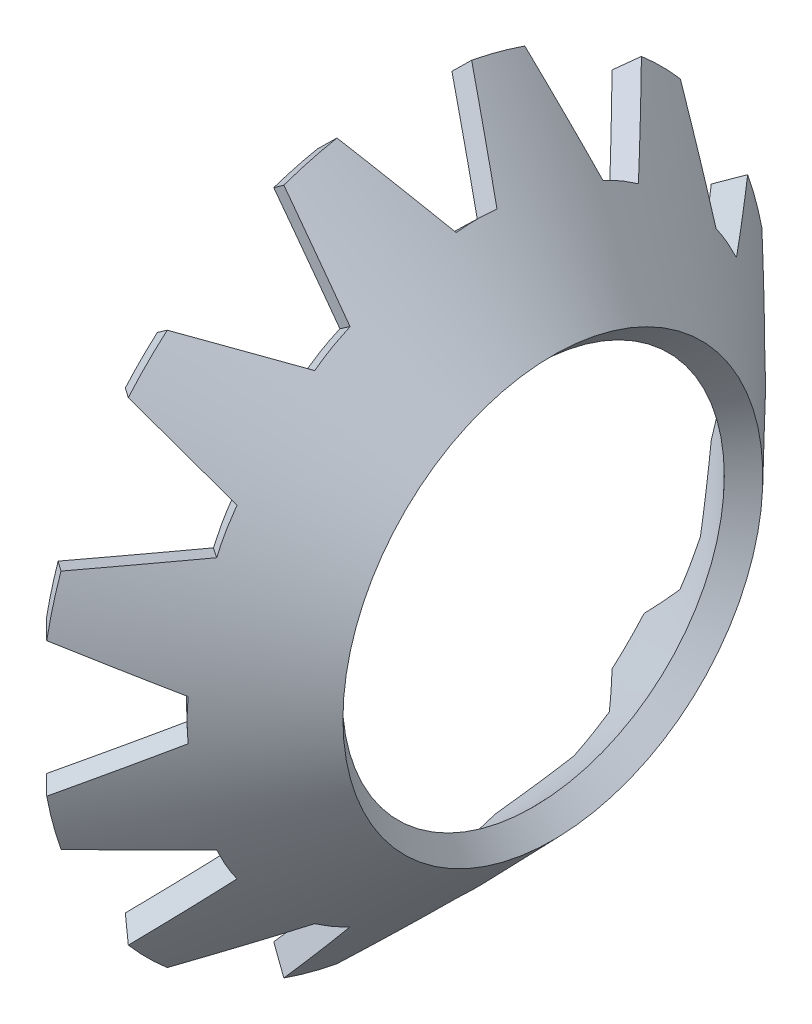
from build123d import *

# Parameters (mm, degrees)
EXTCUT_DEPTH  = 19.184446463
EXTCUTS_COUNT = 12
EXTCUTS_ANGLE = 330


with BuildPart() as part:
    # SecSke → Base-Revolve (revolve)
    with BuildSketch(Plane.XY, mode=Mode.PRIVATE) as base_revolve_sk:
        Polygon((-4.458387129, 4.616795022), (-7.725510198, 8), (-8.157114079, 7.583204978), (-4.889991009, 4.2), align=None)
    revolve(base_revolve_sk.sketch.rotate(Axis((-34.925, 0, 0), (1, 0, 0)), 90), axis=Axis((-34.925, 0, 0), (1, 0, 0)))

    # ExtCutSke → ExtCut (cut, through all)
    with BuildSketch(Plane(origin=(-7.725510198, 8, 0), x_dir=(0, 0, 1), z_dir=(0.7193398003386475, 0.694658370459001, 0))):
        with BuildLine():
            Line((-0.448786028, 2.297632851), (-1.638758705, -0.238596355))
            ThreePointArc((-1.638758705, -0.238596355), (0, -0.4), (1.638758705, -0.238596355))
            Line((1.638758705, -0.238596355), (0.448786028, 2.297632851))
            ThreePointArc((0.448786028, 2.297632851), (0, 2.28), (-0.448786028, 2.297632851))
        make_face()
    extcut = extrude(amount=-EXTCUT_DEPTH, mode=Mode.SUBTRACT)

    # ExtCuts: ExtCut ×12 about axis
    extcuts_axis = Axis((-34.925, 0, 0), (1, 0, 0))
    for i in range(1, EXTCUTS_COUNT):
        add(extcut.rotate(extcuts_axis, i * EXTCUTS_ANGLE / (EXTCUTS_COUNT - 1)), mode=Mode.SUBTRACT)


solid = part.part
